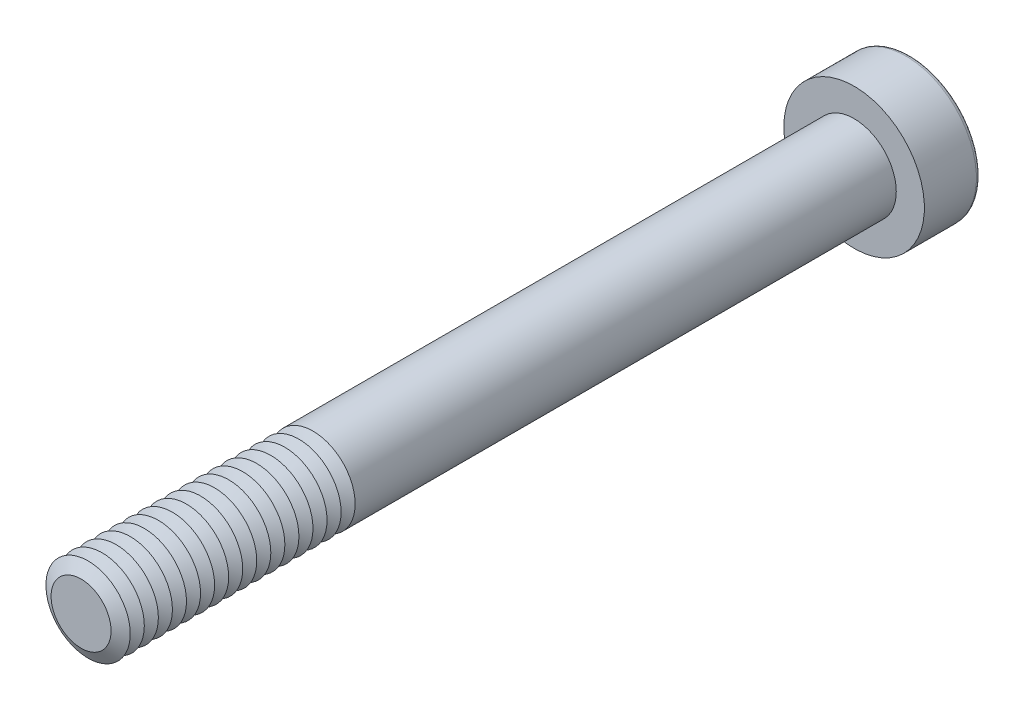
ISO-10303-21;
HEADER;
FILE_DESCRIPTION(('STEP AP214'),'2;1');
FILE_NAME('part.step','',(''),(''),'','','');
FILE_SCHEMA(('AUTOMOTIVE_DESIGN { 1 0 10303 214 1 1 1 1 }'));
ENDSEC;
DATA;
#1=APPLICATION_CONTEXT('core data for automotive mechanical design processes');
#2=APPLICATION_PROTOCOL_DEFINITION('international standard','automotive_design',2000,#1);
#3=PRODUCT_CONTEXT('',#1,'mechanical');
#4=PRODUCT('Part','Part','',(#3));
#5=PRODUCT_RELATED_PRODUCT_CATEGORY('part','',(#4));
#6=PRODUCT_DEFINITION_FORMATION('','',#4);
#7=PRODUCT_DEFINITION_CONTEXT('part definition',#1,'design');
#8=PRODUCT_DEFINITION('design','',#6,#7);
#9=PRODUCT_DEFINITION_SHAPE('','',#8);
#10=(LENGTH_UNIT() NAMED_UNIT(*) SI_UNIT(.MILLI.,.METRE.));
#11=(NAMED_UNIT(*) PLANE_ANGLE_UNIT() SI_UNIT($,.RADIAN.));
#12=(NAMED_UNIT(*) SI_UNIT($,.STERADIAN.) SOLID_ANGLE_UNIT());
#13=UNCERTAINTY_MEASURE_WITH_UNIT(LENGTH_MEASURE(1.E-05),#10,'distance_accuracy_value','');
#14=(GEOMETRIC_REPRESENTATION_CONTEXT(3) GLOBAL_UNCERTAINTY_ASSIGNED_CONTEXT((#13)) GLOBAL_UNIT_ASSIGNED_CONTEXT((#10,
#11,#12)) REPRESENTATION_CONTEXT('',''));
#15=CARTESIAN_POINT('',(0.,0.,0.));
#16=DIRECTION('',(0.,0.,1.));
#17=DIRECTION('',(1.,0.,0.));
#18=AXIS2_PLACEMENT_3D('',#15,#16,#17);
#19=CARTESIAN_POINT('',(0.,0.,51.5));
#20=DIRECTION('',(0.,0.,1.));
#21=DIRECTION('',(1.,0.,0.));
#22=AXIS2_PLACEMENT_3D('',#19,#20,#21);
#23=CONICAL_SURFACE('',#22,3.,1.0471975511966);
#24=CARTESIAN_POINT('',(0.,0.,51.));
#25=DIRECTION('',(0.,0.,1.));
#26=DIRECTION('',(1.,0.,0.));
#27=AXIS2_PLACEMENT_3D('',#24,#25,#26);
#28=CIRCLE('',#27,2.13397459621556);
#29=CARTESIAN_POINT('',(2.13397459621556,0.,51.));
#30=VERTEX_POINT('',#29);
#31=EDGE_CURVE('E313',#30,#30,#28,.T.);
#32=ORIENTED_EDGE('',*,*,#31,.T.);
#33=EDGE_LOOP('',(#32));
#34=FACE_BOUND('',#33,.T.);
#35=CARTESIAN_POINT('',(0.,0.,51.5));
#36=DIRECTION('',(0.,0.,1.));
#37=DIRECTION('',(1.,0.,0.));
#38=AXIS2_PLACEMENT_3D('',#35,#36,#37);
#39=CIRCLE('',#38,3.);
#40=CARTESIAN_POINT('',(3.,0.,51.5));
#41=VERTEX_POINT('',#40);
#42=EDGE_CURVE('E316',#41,#41,#39,.T.);
#43=ORIENTED_EDGE('',*,*,#42,.F.);
#44=EDGE_LOOP('',(#43));
#45=FACE_BOUND('',#44,.T.);
#46=ADVANCED_FACE('F39',(#34,#45),#23,.T.);
#47=CARTESIAN_POINT('',(0.,0.,51.));
#48=DIRECTION('',(0.,0.,-1.));
#49=DIRECTION('',(-1.,0.,0.));
#50=AXIS2_PLACEMENT_3D('',#47,#48,#49);
#51=CONICAL_SURFACE('',#50,2.13397459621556,1.0471975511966);
#52=CARTESIAN_POINT('',(0.,0.,50.5));
#53=DIRECTION('',(0.,0.,1.));
#54=DIRECTION('',(1.,0.,0.));
#55=AXIS2_PLACEMENT_3D('',#52,#53,#54);
#56=CIRCLE('',#55,3.);
#57=CARTESIAN_POINT('',(3.,0.,50.5));
#58=VERTEX_POINT('',#57);
#59=EDGE_CURVE('E324',#58,#58,#56,.T.);
#60=ORIENTED_EDGE('',*,*,#59,.T.);
#61=EDGE_LOOP('',(#60));
#62=FACE_BOUND('',#61,.T.);
#63=ORIENTED_EDGE('',*,*,#31,.F.);
#64=EDGE_LOOP('',(#63));
#65=FACE_BOUND('',#64,.T.);
#66=ADVANCED_FACE('F245',(#62,#65),#51,.T.);
#67=CARTESIAN_POINT('',(0.,0.,55.));
#68=DIRECTION('',(0.,0.,1.));
#69=DIRECTION('',(1.,0.,0.));
#70=AXIS2_PLACEMENT_3D('',#67,#68,#69);
#71=PLANE('',#70);
#72=CARTESIAN_POINT('',(0.,0.,55.));
#73=DIRECTION('',(0.,0.,1.));
#74=DIRECTION('',(1.,0.,0.));
#75=AXIS2_PLACEMENT_3D('',#72,#73,#74);
#76=CIRCLE('',#75,2.13397459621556);
#77=CARTESIAN_POINT('',(2.13397459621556,0.,55.));
#78=VERTEX_POINT('',#77);
#79=EDGE_CURVE('E174',#78,#78,#76,.T.);
#80=ORIENTED_EDGE('',*,*,#79,.T.);
#81=EDGE_LOOP('',(#80));
#82=FACE_BOUND('',#81,.T.);
#83=ADVANCED_FACE('F251',(#82),#71,.T.);
#84=CARTESIAN_POINT('',(0.,0.,55.));
#85=DIRECTION('',(0.,0.,-1.));
#86=DIRECTION('',(-1.,0.,0.));
#87=AXIS2_PLACEMENT_3D('',#84,#85,#86);
#88=CONICAL_SURFACE('',#87,2.13397459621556,1.0471975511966);
#89=CARTESIAN_POINT('',(0.,0.,54.5));
#90=DIRECTION('',(0.,0.,1.));
#91=DIRECTION('',(1.,0.,0.));
#92=AXIS2_PLACEMENT_3D('',#89,#90,#91);
#93=CIRCLE('',#92,3.);
#94=CARTESIAN_POINT('',(3.,0.,54.5));
#95=VERTEX_POINT('',#94);
#96=EDGE_CURVE('E291',#95,#95,#93,.T.);
#97=ORIENTED_EDGE('',*,*,#96,.T.);
#98=EDGE_LOOP('',(#97));
#99=FACE_BOUND('',#98,.T.);
#100=ORIENTED_EDGE('',*,*,#79,.F.);
#101=EDGE_LOOP('',(#100));
#102=FACE_BOUND('',#101,.T.);
#103=ADVANCED_FACE('F199',(#99,#102),#88,.T.);
#104=CARTESIAN_POINT('',(0.,0.,54.5));
#105=DIRECTION('',(0.,0.,1.));
#106=DIRECTION('',(1.,0.,0.));
#107=AXIS2_PLACEMENT_3D('',#104,#105,#106);
#108=CONICAL_SURFACE('',#107,3.,1.0471975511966);
#109=CARTESIAN_POINT('',(0.,0.,54.));
#110=DIRECTION('',(0.,0.,1.));
#111=DIRECTION('',(1.,0.,0.));
#112=AXIS2_PLACEMENT_3D('',#109,#110,#111);
#113=CIRCLE('',#112,2.13397459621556);
#114=CARTESIAN_POINT('',(2.13397459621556,0.,54.));
#115=VERTEX_POINT('',#114);
#116=EDGE_CURVE('E288',#115,#115,#113,.T.);
#117=ORIENTED_EDGE('',*,*,#116,.T.);
#118=EDGE_LOOP('',(#117));
#119=FACE_BOUND('',#118,.T.);
#120=ORIENTED_EDGE('',*,*,#96,.F.);
#121=EDGE_LOOP('',(#120));
#122=FACE_BOUND('',#121,.T.);
#123=ADVANCED_FACE('F277',(#119,#122),#108,.T.);
#124=CARTESIAN_POINT('',(0.,0.,54.));
#125=DIRECTION('',(0.,0.,-1.));
#126=DIRECTION('',(-1.,0.,0.));
#127=AXIS2_PLACEMENT_3D('',#124,#125,#126);
#128=CONICAL_SURFACE('',#127,2.13397459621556,1.0471975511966);
#129=CARTESIAN_POINT('',(0.,0.,53.5));
#130=DIRECTION('',(0.,0.,1.));
#131=DIRECTION('',(1.,0.,0.));
#132=AXIS2_PLACEMENT_3D('',#129,#130,#131);
#133=CIRCLE('',#132,3.);
#134=CARTESIAN_POINT('',(3.,0.,53.5));
#135=VERTEX_POINT('',#134);
#136=EDGE_CURVE('E300',#135,#135,#133,.T.);
#137=ORIENTED_EDGE('',*,*,#136,.T.);
#138=EDGE_LOOP('',(#137));
#139=FACE_BOUND('',#138,.T.);
#140=ORIENTED_EDGE('',*,*,#116,.F.);
#141=EDGE_LOOP('',(#140));
#142=FACE_BOUND('',#141,.T.);
#143=ADVANCED_FACE('F274',(#139,#142),#128,.T.);
#144=CARTESIAN_POINT('',(0.,0.,53.5));
#145=DIRECTION('',(0.,0.,1.));
#146=DIRECTION('',(1.,0.,0.));
#147=AXIS2_PLACEMENT_3D('',#144,#145,#146);
#148=CONICAL_SURFACE('',#147,3.,1.0471975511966);
#149=CARTESIAN_POINT('',(0.,0.,53.));
#150=DIRECTION('',(0.,0.,1.));
#151=DIRECTION('',(1.,0.,0.));
#152=AXIS2_PLACEMENT_3D('',#149,#150,#151);
#153=CIRCLE('',#152,2.13397459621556);
#154=CARTESIAN_POINT('',(2.13397459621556,0.,53.));
#155=VERTEX_POINT('',#154);
#156=EDGE_CURVE('E293',#155,#155,#153,.T.);
#157=ORIENTED_EDGE('',*,*,#156,.T.);
#158=EDGE_LOOP('',(#157));
#159=FACE_BOUND('',#158,.T.);
#160=ORIENTED_EDGE('',*,*,#136,.F.);
#161=EDGE_LOOP('',(#160));
#162=FACE_BOUND('',#161,.T.);
#163=ADVANCED_FACE('F270',(#159,#162),#148,.T.);
#164=CARTESIAN_POINT('',(0.,0.,53.));
#165=DIRECTION('',(0.,0.,-1.));
#166=DIRECTION('',(-1.,0.,0.));
#167=AXIS2_PLACEMENT_3D('',#164,#165,#166);
#168=CONICAL_SURFACE('',#167,2.13397459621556,1.0471975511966);
#169=CARTESIAN_POINT('',(0.,0.,52.5));
#170=DIRECTION('',(0.,0.,1.));
#171=DIRECTION('',(1.,0.,0.));
#172=AXIS2_PLACEMENT_3D('',#169,#170,#171);
#173=CIRCLE('',#172,3.);
#174=CARTESIAN_POINT('',(3.,0.,52.5));
#175=VERTEX_POINT('',#174);
#176=EDGE_CURVE('E309',#175,#175,#173,.T.);
#177=ORIENTED_EDGE('',*,*,#176,.T.);
#178=EDGE_LOOP('',(#177));
#179=FACE_BOUND('',#178,.T.);
#180=ORIENTED_EDGE('',*,*,#156,.F.);
#181=EDGE_LOOP('',(#180));
#182=FACE_BOUND('',#181,.T.);
#183=ADVANCED_FACE('F266',(#179,#182),#168,.T.);
#184=CARTESIAN_POINT('',(0.,0.,52.5));
#185=DIRECTION('',(0.,0.,1.));
#186=DIRECTION('',(1.,0.,0.));
#187=AXIS2_PLACEMENT_3D('',#184,#185,#186);
#188=CONICAL_SURFACE('',#187,3.,1.0471975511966);
#189=CARTESIAN_POINT('',(0.,0.,52.));
#190=DIRECTION('',(0.,0.,1.));
#191=DIRECTION('',(1.,0.,0.));
#192=AXIS2_PLACEMENT_3D('',#189,#190,#191);
#193=CIRCLE('',#192,2.13397459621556);
#194=CARTESIAN_POINT('',(2.13397459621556,0.,52.));
#195=VERTEX_POINT('',#194);
#196=EDGE_CURVE('E306',#195,#195,#193,.T.);
#197=ORIENTED_EDGE('',*,*,#196,.T.);
#198=EDGE_LOOP('',(#197));
#199=FACE_BOUND('',#198,.T.);
#200=ORIENTED_EDGE('',*,*,#176,.F.);
#201=EDGE_LOOP('',(#200));
#202=FACE_BOUND('',#201,.T.);
#203=ADVANCED_FACE('F262',(#199,#202),#188,.T.);
#204=CARTESIAN_POINT('',(0.,0.,52.));
#205=DIRECTION('',(0.,0.,-1.));
#206=DIRECTION('',(-1.,0.,0.));
#207=AXIS2_PLACEMENT_3D('',#204,#205,#206);
#208=CONICAL_SURFACE('',#207,2.13397459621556,1.0471975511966);
#209=ORIENTED_EDGE('',*,*,#42,.T.);
#210=EDGE_LOOP('',(#209));
#211=FACE_BOUND('',#210,.T.);
#212=ORIENTED_EDGE('',*,*,#196,.F.);
#213=EDGE_LOOP('',(#212));
#214=FACE_BOUND('',#213,.T.);
#215=ADVANCED_FACE('F258',(#211,#214),#208,.T.);
#216=CARTESIAN_POINT('',(0.,0.,50.5));
#217=DIRECTION('',(0.,0.,1.));
#218=DIRECTION('',(1.,0.,0.));
#219=AXIS2_PLACEMENT_3D('',#216,#217,#218);
#220=CONICAL_SURFACE('',#219,3.,1.0471975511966);
#221=CARTESIAN_POINT('',(0.,0.,50.));
#222=DIRECTION('',(0.,0.,1.));
#223=DIRECTION('',(1.,0.,0.));
#224=AXIS2_PLACEMENT_3D('',#221,#222,#223);
#225=CIRCLE('',#224,2.13397459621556);
#226=CARTESIAN_POINT('',(2.13397459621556,0.,50.));
#227=VERTEX_POINT('',#226);
#228=EDGE_CURVE('E320',#227,#227,#225,.T.);
#229=ORIENTED_EDGE('',*,*,#228,.T.);
#230=EDGE_LOOP('',(#229));
#231=FACE_BOUND('',#230,.T.);
#232=ORIENTED_EDGE('',*,*,#59,.F.);
#233=EDGE_LOOP('',(#232));
#234=FACE_BOUND('',#233,.T.);
#235=ADVANCED_FACE('F261',(#231,#234),#220,.T.);
#236=CARTESIAN_POINT('',(0.,0.,50.));
#237=DIRECTION('',(0.,0.,-1.));
#238=DIRECTION('',(-1.,0.,0.));
#239=AXIS2_PLACEMENT_3D('',#236,#237,#238);
#240=CONICAL_SURFACE('',#239,2.13397459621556,1.0471975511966);
#241=CARTESIAN_POINT('',(0.,0.,49.5));
#242=DIRECTION('',(0.,0.,1.));
#243=DIRECTION('',(1.,0.,0.));
#244=AXIS2_PLACEMENT_3D('',#241,#242,#243);
#245=CIRCLE('',#244,3.);
#246=CARTESIAN_POINT('',(3.,0.,49.5));
#247=VERTEX_POINT('',#246);
#248=EDGE_CURVE('E332',#247,#247,#245,.T.);
#249=ORIENTED_EDGE('',*,*,#248,.T.);
#250=EDGE_LOOP('',(#249));
#251=FACE_BOUND('',#250,.T.);
#252=ORIENTED_EDGE('',*,*,#228,.F.);
#253=EDGE_LOOP('',(#252));
#254=FACE_BOUND('',#253,.T.);
#255=ADVANCED_FACE('F511',(#251,#254),#240,.T.);
#256=CARTESIAN_POINT('',(0.,0.,49.5));
#257=DIRECTION('',(0.,0.,1.));
#258=DIRECTION('',(1.,0.,0.));
#259=AXIS2_PLACEMENT_3D('',#256,#257,#258);
#260=CONICAL_SURFACE('',#259,3.,1.0471975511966);
#261=CARTESIAN_POINT('',(0.,0.,49.));
#262=DIRECTION('',(0.,0.,1.));
#263=DIRECTION('',(1.,0.,0.));
#264=AXIS2_PLACEMENT_3D('',#261,#262,#263);
#265=CIRCLE('',#264,2.13397459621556);
#266=CARTESIAN_POINT('',(2.13397459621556,0.,49.));
#267=VERTEX_POINT('',#266);
#268=EDGE_CURVE('E328',#267,#267,#265,.T.);
#269=ORIENTED_EDGE('',*,*,#268,.T.);
#270=EDGE_LOOP('',(#269));
#271=FACE_BOUND('',#270,.T.);
#272=ORIENTED_EDGE('',*,*,#248,.F.);
#273=EDGE_LOOP('',(#272));
#274=FACE_BOUND('',#273,.T.);
#275=ADVANCED_FACE('F507',(#271,#274),#260,.T.);
#276=CARTESIAN_POINT('',(0.,0.,49.));
#277=DIRECTION('',(0.,0.,-1.));
#278=DIRECTION('',(-1.,0.,0.));
#279=AXIS2_PLACEMENT_3D('',#276,#277,#278);
#280=CONICAL_SURFACE('',#279,2.13397459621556,1.0471975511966);
#281=CARTESIAN_POINT('',(0.,0.,48.5));
#282=DIRECTION('',(0.,0.,1.));
#283=DIRECTION('',(1.,0.,0.));
#284=AXIS2_PLACEMENT_3D('',#281,#282,#283);
#285=CIRCLE('',#284,3.);
#286=CARTESIAN_POINT('',(3.,0.,48.5));
#287=VERTEX_POINT('',#286);
#288=EDGE_CURVE('E340',#287,#287,#285,.T.);
#289=ORIENTED_EDGE('',*,*,#288,.T.);
#290=EDGE_LOOP('',(#289));
#291=FACE_BOUND('',#290,.T.);
#292=ORIENTED_EDGE('',*,*,#268,.F.);
#293=EDGE_LOOP('',(#292));
#294=FACE_BOUND('',#293,.T.);
#295=ADVANCED_FACE('F503',(#291,#294),#280,.T.);
#296=CARTESIAN_POINT('',(0.,0.,48.5));
#297=DIRECTION('',(0.,0.,1.));
#298=DIRECTION('',(1.,0.,0.));
#299=AXIS2_PLACEMENT_3D('',#296,#297,#298);
#300=CONICAL_SURFACE('',#299,3.,1.0471975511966);
#301=CARTESIAN_POINT('',(0.,0.,48.));
#302=DIRECTION('',(0.,0.,1.));
#303=DIRECTION('',(1.,0.,0.));
#304=AXIS2_PLACEMENT_3D('',#301,#302,#303);
#305=CIRCLE('',#304,2.13397459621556);
#306=CARTESIAN_POINT('',(2.13397459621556,0.,48.));
#307=VERTEX_POINT('',#306);
#308=EDGE_CURVE('E336',#307,#307,#305,.T.);
#309=ORIENTED_EDGE('',*,*,#308,.T.);
#310=EDGE_LOOP('',(#309));
#311=FACE_BOUND('',#310,.T.);
#312=ORIENTED_EDGE('',*,*,#288,.F.);
#313=EDGE_LOOP('',(#312));
#314=FACE_BOUND('',#313,.T.);
#315=ADVANCED_FACE('F499',(#311,#314),#300,.T.);
#316=CARTESIAN_POINT('',(0.,0.,48.));
#317=DIRECTION('',(0.,0.,-1.));
#318=DIRECTION('',(-1.,0.,0.));
#319=AXIS2_PLACEMENT_3D('',#316,#317,#318);
#320=CONICAL_SURFACE('',#319,2.13397459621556,1.0471975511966);
#321=CARTESIAN_POINT('',(0.,0.,47.5));
#322=DIRECTION('',(0.,0.,1.));
#323=DIRECTION('',(1.,0.,0.));
#324=AXIS2_PLACEMENT_3D('',#321,#322,#323);
#325=CIRCLE('',#324,3.);
#326=CARTESIAN_POINT('',(3.,0.,47.5));
#327=VERTEX_POINT('',#326);
#328=EDGE_CURVE('E348',#327,#327,#325,.T.);
#329=ORIENTED_EDGE('',*,*,#328,.T.);
#330=EDGE_LOOP('',(#329));
#331=FACE_BOUND('',#330,.T.);
#332=ORIENTED_EDGE('',*,*,#308,.F.);
#333=EDGE_LOOP('',(#332));
#334=FACE_BOUND('',#333,.T.);
#335=ADVANCED_FACE('F495',(#331,#334),#320,.T.);
#336=CARTESIAN_POINT('',(0.,0.,47.5));
#337=DIRECTION('',(0.,0.,1.));
#338=DIRECTION('',(1.,0.,0.));
#339=AXIS2_PLACEMENT_3D('',#336,#337,#338);
#340=CONICAL_SURFACE('',#339,3.,1.0471975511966);
#341=CARTESIAN_POINT('',(0.,0.,47.));
#342=DIRECTION('',(0.,0.,1.));
#343=DIRECTION('',(1.,0.,0.));
#344=AXIS2_PLACEMENT_3D('',#341,#342,#343);
#345=CIRCLE('',#344,2.13397459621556);
#346=CARTESIAN_POINT('',(2.13397459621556,0.,47.));
#347=VERTEX_POINT('',#346);
#348=EDGE_CURVE('E344',#347,#347,#345,.T.);
#349=ORIENTED_EDGE('',*,*,#348,.T.);
#350=EDGE_LOOP('',(#349));
#351=FACE_BOUND('',#350,.T.);
#352=ORIENTED_EDGE('',*,*,#328,.F.);
#353=EDGE_LOOP('',(#352));
#354=FACE_BOUND('',#353,.T.);
#355=ADVANCED_FACE('F491',(#351,#354),#340,.T.);
#356=CARTESIAN_POINT('',(0.,0.,47.));
#357=DIRECTION('',(0.,0.,-1.));
#358=DIRECTION('',(-1.,0.,0.));
#359=AXIS2_PLACEMENT_3D('',#356,#357,#358);
#360=CONICAL_SURFACE('',#359,2.13397459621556,1.0471975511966);
#361=CARTESIAN_POINT('',(0.,0.,46.5));
#362=DIRECTION('',(0.,0.,1.));
#363=DIRECTION('',(1.,0.,0.));
#364=AXIS2_PLACEMENT_3D('',#361,#362,#363);
#365=CIRCLE('',#364,3.);
#366=CARTESIAN_POINT('',(3.,0.,46.5));
#367=VERTEX_POINT('',#366);
#368=EDGE_CURVE('E356',#367,#367,#365,.T.);
#369=ORIENTED_EDGE('',*,*,#368,.T.);
#370=EDGE_LOOP('',(#369));
#371=FACE_BOUND('',#370,.T.);
#372=ORIENTED_EDGE('',*,*,#348,.F.);
#373=EDGE_LOOP('',(#372));
#374=FACE_BOUND('',#373,.T.);
#375=ADVANCED_FACE('F487',(#371,#374),#360,.T.);
#376=CARTESIAN_POINT('',(0.,0.,46.5));
#377=DIRECTION('',(0.,0.,1.));
#378=DIRECTION('',(1.,0.,0.));
#379=AXIS2_PLACEMENT_3D('',#376,#377,#378);
#380=CONICAL_SURFACE('',#379,3.,1.0471975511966);
#381=CARTESIAN_POINT('',(0.,0.,46.));
#382=DIRECTION('',(0.,0.,1.));
#383=DIRECTION('',(1.,0.,0.));
#384=AXIS2_PLACEMENT_3D('',#381,#382,#383);
#385=CIRCLE('',#384,2.13397459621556);
#386=CARTESIAN_POINT('',(2.13397459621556,0.,46.));
#387=VERTEX_POINT('',#386);
#388=EDGE_CURVE('E352',#387,#387,#385,.T.);
#389=ORIENTED_EDGE('',*,*,#388,.T.);
#390=EDGE_LOOP('',(#389));
#391=FACE_BOUND('',#390,.T.);
#392=ORIENTED_EDGE('',*,*,#368,.F.);
#393=EDGE_LOOP('',(#392));
#394=FACE_BOUND('',#393,.T.);
#395=ADVANCED_FACE('F483',(#391,#394),#380,.T.);
#396=CARTESIAN_POINT('',(0.,0.,46.));
#397=DIRECTION('',(0.,0.,-1.));
#398=DIRECTION('',(-1.,0.,0.));
#399=AXIS2_PLACEMENT_3D('',#396,#397,#398);
#400=CONICAL_SURFACE('',#399,2.13397459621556,1.0471975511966);
#401=CARTESIAN_POINT('',(0.,0.,45.5));
#402=DIRECTION('',(0.,0.,1.));
#403=DIRECTION('',(1.,0.,0.));
#404=AXIS2_PLACEMENT_3D('',#401,#402,#403);
#405=CIRCLE('',#404,3.);
#406=CARTESIAN_POINT('',(3.,0.,45.5));
#407=VERTEX_POINT('',#406);
#408=EDGE_CURVE('E364',#407,#407,#405,.T.);
#409=ORIENTED_EDGE('',*,*,#408,.T.);
#410=EDGE_LOOP('',(#409));
#411=FACE_BOUND('',#410,.T.);
#412=ORIENTED_EDGE('',*,*,#388,.F.);
#413=EDGE_LOOP('',(#412));
#414=FACE_BOUND('',#413,.T.);
#415=ADVANCED_FACE('F479',(#411,#414),#400,.T.);
#416=CARTESIAN_POINT('',(0.,0.,45.5));
#417=DIRECTION('',(0.,0.,1.));
#418=DIRECTION('',(1.,0.,0.));
#419=AXIS2_PLACEMENT_3D('',#416,#417,#418);
#420=CONICAL_SURFACE('',#419,3.,1.0471975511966);
#421=CARTESIAN_POINT('',(0.,0.,45.));
#422=DIRECTION('',(0.,0.,1.));
#423=DIRECTION('',(1.,0.,0.));
#424=AXIS2_PLACEMENT_3D('',#421,#422,#423);
#425=CIRCLE('',#424,2.13397459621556);
#426=CARTESIAN_POINT('',(2.13397459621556,0.,45.));
#427=VERTEX_POINT('',#426);
#428=EDGE_CURVE('E360',#427,#427,#425,.T.);
#429=ORIENTED_EDGE('',*,*,#428,.T.);
#430=EDGE_LOOP('',(#429));
#431=FACE_BOUND('',#430,.T.);
#432=ORIENTED_EDGE('',*,*,#408,.F.);
#433=EDGE_LOOP('',(#432));
#434=FACE_BOUND('',#433,.T.);
#435=ADVANCED_FACE('F475',(#431,#434),#420,.T.);
#436=CARTESIAN_POINT('',(0.,0.,45.));
#437=DIRECTION('',(0.,0.,-1.));
#438=DIRECTION('',(-1.,0.,0.));
#439=AXIS2_PLACEMENT_3D('',#436,#437,#438);
#440=CONICAL_SURFACE('',#439,2.13397459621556,1.0471975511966);
#441=CARTESIAN_POINT('',(0.,0.,44.5));
#442=DIRECTION('',(0.,0.,1.));
#443=DIRECTION('',(1.,0.,0.));
#444=AXIS2_PLACEMENT_3D('',#441,#442,#443);
#445=CIRCLE('',#444,3.);
#446=CARTESIAN_POINT('',(3.,0.,44.5));
#447=VERTEX_POINT('',#446);
#448=EDGE_CURVE('E372',#447,#447,#445,.T.);
#449=ORIENTED_EDGE('',*,*,#448,.T.);
#450=EDGE_LOOP('',(#449));
#451=FACE_BOUND('',#450,.T.);
#452=ORIENTED_EDGE('',*,*,#428,.F.);
#453=EDGE_LOOP('',(#452));
#454=FACE_BOUND('',#453,.T.);
#455=ADVANCED_FACE('F471',(#451,#454),#440,.T.);
#456=CARTESIAN_POINT('',(0.,0.,44.5));
#457=DIRECTION('',(0.,0.,1.));
#458=DIRECTION('',(1.,0.,0.));
#459=AXIS2_PLACEMENT_3D('',#456,#457,#458);
#460=CONICAL_SURFACE('',#459,3.,1.0471975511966);
#461=CARTESIAN_POINT('',(0.,0.,44.));
#462=DIRECTION('',(0.,0.,1.));
#463=DIRECTION('',(1.,0.,0.));
#464=AXIS2_PLACEMENT_3D('',#461,#462,#463);
#465=CIRCLE('',#464,2.13397459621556);
#466=CARTESIAN_POINT('',(2.13397459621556,0.,44.));
#467=VERTEX_POINT('',#466);
#468=EDGE_CURVE('E368',#467,#467,#465,.T.);
#469=ORIENTED_EDGE('',*,*,#468,.T.);
#470=EDGE_LOOP('',(#469));
#471=FACE_BOUND('',#470,.T.);
#472=ORIENTED_EDGE('',*,*,#448,.F.);
#473=EDGE_LOOP('',(#472));
#474=FACE_BOUND('',#473,.T.);
#475=ADVANCED_FACE('F467',(#471,#474),#460,.T.);
#476=CARTESIAN_POINT('',(0.,0.,44.));
#477=DIRECTION('',(0.,0.,-1.));
#478=DIRECTION('',(-1.,0.,0.));
#479=AXIS2_PLACEMENT_3D('',#476,#477,#478);
#480=CONICAL_SURFACE('',#479,2.13397459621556,1.0471975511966);
#481=CARTESIAN_POINT('',(0.,0.,43.5));
#482=DIRECTION('',(0.,0.,1.));
#483=DIRECTION('',(1.,0.,0.));
#484=AXIS2_PLACEMENT_3D('',#481,#482,#483);
#485=CIRCLE('',#484,3.);
#486=CARTESIAN_POINT('',(3.,0.,43.5));
#487=VERTEX_POINT('',#486);
#488=EDGE_CURVE('E380',#487,#487,#485,.T.);
#489=ORIENTED_EDGE('',*,*,#488,.T.);
#490=EDGE_LOOP('',(#489));
#491=FACE_BOUND('',#490,.T.);
#492=ORIENTED_EDGE('',*,*,#468,.F.);
#493=EDGE_LOOP('',(#492));
#494=FACE_BOUND('',#493,.T.);
#495=ADVANCED_FACE('F463',(#491,#494),#480,.T.);
#496=CARTESIAN_POINT('',(0.,0.,43.5));
#497=DIRECTION('',(0.,0.,1.));
#498=DIRECTION('',(1.,0.,0.));
#499=AXIS2_PLACEMENT_3D('',#496,#497,#498);
#500=CONICAL_SURFACE('',#499,3.,1.0471975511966);
#501=CARTESIAN_POINT('',(0.,0.,43.));
#502=DIRECTION('',(0.,0.,1.));
#503=DIRECTION('',(1.,0.,0.));
#504=AXIS2_PLACEMENT_3D('',#501,#502,#503);
#505=CIRCLE('',#504,2.13397459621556);
#506=CARTESIAN_POINT('',(2.13397459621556,0.,43.));
#507=VERTEX_POINT('',#506);
#508=EDGE_CURVE('E376',#507,#507,#505,.T.);
#509=ORIENTED_EDGE('',*,*,#508,.T.);
#510=EDGE_LOOP('',(#509));
#511=FACE_BOUND('',#510,.T.);
#512=ORIENTED_EDGE('',*,*,#488,.F.);
#513=EDGE_LOOP('',(#512));
#514=FACE_BOUND('',#513,.T.);
#515=ADVANCED_FACE('F459',(#511,#514),#500,.T.);
#516=CARTESIAN_POINT('',(0.,0.,43.));
#517=DIRECTION('',(0.,0.,-1.));
#518=DIRECTION('',(-1.,0.,0.));
#519=AXIS2_PLACEMENT_3D('',#516,#517,#518);
#520=CONICAL_SURFACE('',#519,2.13397459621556,1.0471975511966);
#521=CARTESIAN_POINT('',(0.,0.,42.5));
#522=DIRECTION('',(0.,0.,1.));
#523=DIRECTION('',(1.,0.,0.));
#524=AXIS2_PLACEMENT_3D('',#521,#522,#523);
#525=CIRCLE('',#524,3.);
#526=CARTESIAN_POINT('',(3.,0.,42.5));
#527=VERTEX_POINT('',#526);
#528=EDGE_CURVE('E388',#527,#527,#525,.T.);
#529=ORIENTED_EDGE('',*,*,#528,.T.);
#530=EDGE_LOOP('',(#529));
#531=FACE_BOUND('',#530,.T.);
#532=ORIENTED_EDGE('',*,*,#508,.F.);
#533=EDGE_LOOP('',(#532));
#534=FACE_BOUND('',#533,.T.);
#535=ADVANCED_FACE('F455',(#531,#534),#520,.T.);
#536=CARTESIAN_POINT('',(0.,0.,42.5));
#537=DIRECTION('',(0.,0.,1.));
#538=DIRECTION('',(1.,0.,0.));
#539=AXIS2_PLACEMENT_3D('',#536,#537,#538);
#540=CONICAL_SURFACE('',#539,3.,1.0471975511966);
#541=CARTESIAN_POINT('',(0.,0.,42.));
#542=DIRECTION('',(0.,0.,1.));
#543=DIRECTION('',(1.,0.,0.));
#544=AXIS2_PLACEMENT_3D('',#541,#542,#543);
#545=CIRCLE('',#544,2.13397459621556);
#546=CARTESIAN_POINT('',(2.13397459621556,0.,42.));
#547=VERTEX_POINT('',#546);
#548=EDGE_CURVE('E384',#547,#547,#545,.T.);
#549=ORIENTED_EDGE('',*,*,#548,.T.);
#550=EDGE_LOOP('',(#549));
#551=FACE_BOUND('',#550,.T.);
#552=ORIENTED_EDGE('',*,*,#528,.F.);
#553=EDGE_LOOP('',(#552));
#554=FACE_BOUND('',#553,.T.);
#555=ADVANCED_FACE('F451',(#551,#554),#540,.T.);
#556=CARTESIAN_POINT('',(0.,0.,42.));
#557=DIRECTION('',(0.,0.,-1.));
#558=DIRECTION('',(-1.,0.,0.));
#559=AXIS2_PLACEMENT_3D('',#556,#557,#558);
#560=CONICAL_SURFACE('',#559,2.13397459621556,1.0471975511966);
#561=CARTESIAN_POINT('',(0.,0.,41.5));
#562=DIRECTION('',(0.,0.,1.));
#563=DIRECTION('',(1.,0.,0.));
#564=AXIS2_PLACEMENT_3D('',#561,#562,#563);
#565=CIRCLE('',#564,3.);
#566=CARTESIAN_POINT('',(3.,0.,41.5));
#567=VERTEX_POINT('',#566);
#568=EDGE_CURVE('E396',#567,#567,#565,.T.);
#569=ORIENTED_EDGE('',*,*,#568,.T.);
#570=EDGE_LOOP('',(#569));
#571=FACE_BOUND('',#570,.T.);
#572=ORIENTED_EDGE('',*,*,#548,.F.);
#573=EDGE_LOOP('',(#572));
#574=FACE_BOUND('',#573,.T.);
#575=ADVANCED_FACE('F447',(#571,#574),#560,.T.);
#576=CARTESIAN_POINT('',(0.,0.,41.5));
#577=DIRECTION('',(0.,0.,1.));
#578=DIRECTION('',(1.,0.,0.));
#579=AXIS2_PLACEMENT_3D('',#576,#577,#578);
#580=CONICAL_SURFACE('',#579,3.,1.0471975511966);
#581=CARTESIAN_POINT('',(0.,0.,41.));
#582=DIRECTION('',(0.,0.,1.));
#583=DIRECTION('',(1.,0.,0.));
#584=AXIS2_PLACEMENT_3D('',#581,#582,#583);
#585=CIRCLE('',#584,2.13397459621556);
#586=CARTESIAN_POINT('',(2.13397459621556,0.,41.));
#587=VERTEX_POINT('',#586);
#588=EDGE_CURVE('E392',#587,#587,#585,.T.);
#589=ORIENTED_EDGE('',*,*,#588,.T.);
#590=EDGE_LOOP('',(#589));
#591=FACE_BOUND('',#590,.T.);
#592=ORIENTED_EDGE('',*,*,#568,.F.);
#593=EDGE_LOOP('',(#592));
#594=FACE_BOUND('',#593,.T.);
#595=ADVANCED_FACE('F443',(#591,#594),#580,.T.);
#596=CARTESIAN_POINT('',(0.,0.,41.));
#597=DIRECTION('',(0.,0.,-1.));
#598=DIRECTION('',(-1.,0.,0.));
#599=AXIS2_PLACEMENT_3D('',#596,#597,#598);
#600=CONICAL_SURFACE('',#599,2.13397459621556,1.0471975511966);
#601=CARTESIAN_POINT('',(0.,0.,40.5));
#602=DIRECTION('',(0.,0.,1.));
#603=DIRECTION('',(1.,0.,0.));
#604=AXIS2_PLACEMENT_3D('',#601,#602,#603);
#605=CIRCLE('',#604,3.);
#606=CARTESIAN_POINT('',(3.,0.,40.5));
#607=VERTEX_POINT('',#606);
#608=EDGE_CURVE('E403',#607,#607,#605,.T.);
#609=ORIENTED_EDGE('',*,*,#608,.T.);
#610=EDGE_LOOP('',(#609));
#611=FACE_BOUND('',#610,.T.);
#612=ORIENTED_EDGE('',*,*,#588,.F.);
#613=EDGE_LOOP('',(#612));
#614=FACE_BOUND('',#613,.T.);
#615=ADVANCED_FACE('F439',(#611,#614),#600,.T.);
#616=CARTESIAN_POINT('',(0.,0.,40.5));
#617=DIRECTION('',(0.,0.,1.));
#618=DIRECTION('',(1.,0.,0.));
#619=AXIS2_PLACEMENT_3D('',#616,#617,#618);
#620=CONICAL_SURFACE('',#619,3.,1.0471975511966);
#621=CARTESIAN_POINT('',(0.,0.,40.));
#622=DIRECTION('',(0.,0.,1.));
#623=DIRECTION('',(1.,0.,0.));
#624=AXIS2_PLACEMENT_3D('',#621,#622,#623);
#625=CIRCLE('',#624,2.13397459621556);
#626=CARTESIAN_POINT('',(2.13397459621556,0.,40.));
#627=VERTEX_POINT('',#626);
#628=EDGE_CURVE('E400',#627,#627,#625,.T.);
#629=ORIENTED_EDGE('',*,*,#628,.T.);
#630=EDGE_LOOP('',(#629));
#631=FACE_BOUND('',#630,.T.);
#632=ORIENTED_EDGE('',*,*,#608,.F.);
#633=EDGE_LOOP('',(#632));
#634=FACE_BOUND('',#633,.T.);
#635=ADVANCED_FACE('F434',(#631,#634),#620,.T.);
#636=CARTESIAN_POINT('',(0.,0.,40.));
#637=DIRECTION('',(0.,0.,-1.));
#638=DIRECTION('',(-1.,0.,0.));
#639=AXIS2_PLACEMENT_3D('',#636,#637,#638);
#640=CONICAL_SURFACE('',#639,2.13397459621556,1.0471975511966);
#641=CARTESIAN_POINT('',(0.,0.,39.5));
#642=DIRECTION('',(0.,0.,1.));
#643=DIRECTION('',(1.,0.,0.));
#644=AXIS2_PLACEMENT_3D('',#641,#642,#643);
#645=CIRCLE('',#644,3.);
#646=CARTESIAN_POINT('',(3.,0.,39.5));
#647=VERTEX_POINT('',#646);
#648=EDGE_CURVE('E415',#647,#647,#645,.T.);
#649=ORIENTED_EDGE('',*,*,#648,.T.);
#650=EDGE_LOOP('',(#649));
#651=FACE_BOUND('',#650,.T.);
#652=ORIENTED_EDGE('',*,*,#628,.F.);
#653=EDGE_LOOP('',(#652));
#654=FACE_BOUND('',#653,.T.);
#655=ADVANCED_FACE('F420',(#651,#654),#640,.T.);
#656=CARTESIAN_POINT('',(0.,0.,39.5));
#657=DIRECTION('',(0.,0.,1.));
#658=DIRECTION('',(1.,0.,0.));
#659=AXIS2_PLACEMENT_3D('',#656,#657,#658);
#660=CONICAL_SURFACE('',#659,3.,1.0471975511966);
#661=CARTESIAN_POINT('',(0.,0.,39.));
#662=DIRECTION('',(0.,0.,1.));
#663=DIRECTION('',(1.,0.,0.));
#664=AXIS2_PLACEMENT_3D('',#661,#662,#663);
#665=CIRCLE('',#664,2.13397459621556);
#666=CARTESIAN_POINT('',(2.13397459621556,0.,39.));
#667=VERTEX_POINT('',#666);
#668=EDGE_CURVE('E407',#667,#667,#665,.T.);
#669=ORIENTED_EDGE('',*,*,#668,.T.);
#670=EDGE_LOOP('',(#669));
#671=FACE_BOUND('',#670,.T.);
#672=ORIENTED_EDGE('',*,*,#648,.F.);
#673=EDGE_LOOP('',(#672));
#674=FACE_BOUND('',#673,.T.);
#675=ADVANCED_FACE('F423',(#671,#674),#660,.T.);
#676=CARTESIAN_POINT('',(0.,0.,39.));
#677=DIRECTION('',(0.,0.,-1.));
#678=DIRECTION('',(-1.,0.,0.));
#679=AXIS2_PLACEMENT_3D('',#676,#677,#678);
#680=CONICAL_SURFACE('',#679,2.13397459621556,1.0471975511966);
#681=CARTESIAN_POINT('',(0.,0.,38.5));
#682=DIRECTION('',(0.,0.,1.));
#683=DIRECTION('',(1.,0.,0.));
#684=AXIS2_PLACEMENT_3D('',#681,#682,#683);
#685=CIRCLE('',#684,3.);
#686=CARTESIAN_POINT('',(3.,0.,38.5));
#687=VERTEX_POINT('',#686);
#688=EDGE_CURVE('E411',#687,#687,#685,.T.);
#689=ORIENTED_EDGE('',*,*,#688,.T.);
#690=EDGE_LOOP('',(#689));
#691=FACE_BOUND('',#690,.T.);
#692=ORIENTED_EDGE('',*,*,#668,.F.);
#693=EDGE_LOOP('',(#692));
#694=FACE_BOUND('',#693,.T.);
#695=ADVANCED_FACE('F425',(#691,#694),#680,.T.);
#696=CARTESIAN_POINT('',(0.,0.,-1.));
#697=DIRECTION('',(0.,0.,-1.));
#698=DIRECTION('',(-1.,0.,0.));
#699=AXIS2_PLACEMENT_3D('',#696,#697,#698);
#700=CONICAL_SURFACE('',#699,2.,1.0471975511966);
#701=CARTESIAN_POINT('',(0.,0.,0.154700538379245));
#702=VERTEX_POINT('',#701);
#703=VERTEX_LOOP('',#702);
#704=FACE_BOUND('',#703,.T.);
#705=CARTESIAN_POINT('',(0.,0.,-1.));
#706=DIRECTION('',(0.,0.,-1.));
#707=DIRECTION('',(-1.,0.,0.));
#708=AXIS2_PLACEMENT_3D('',#705,#706,#707);
#709=CIRCLE('',#708,2.);
#710=CARTESIAN_POINT('',(-1.73205080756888,0.999999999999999,-1.));
#711=VERTEX_POINT('',#710);
#712=CARTESIAN_POINT('',(0.,2.,-1.));
#713=VERTEX_POINT('',#712);
#714=EDGE_CURVE('E149',#711,#713,#709,.T.);
#715=ORIENTED_EDGE('',*,*,#714,.T.);
#716=CARTESIAN_POINT('',(0.,0.,-1.));
#717=DIRECTION('',(0.,0.,-1.));
#718=DIRECTION('',(-1.,0.,0.));
#719=AXIS2_PLACEMENT_3D('',#716,#717,#718);
#720=CIRCLE('',#719,2.);
#721=CARTESIAN_POINT('',(1.73205080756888,1.,-1.));
#722=VERTEX_POINT('',#721);
#723=EDGE_CURVE('E54',#713,#722,#720,.T.);
#724=ORIENTED_EDGE('',*,*,#723,.T.);
#725=CARTESIAN_POINT('',(1.73205080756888,-0.999999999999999,-1.));
#726=VERTEX_POINT('',#725);
#727=EDGE_CURVE('E1028',#722,#726,#720,.T.);
#728=ORIENTED_EDGE('',*,*,#727,.T.);
#729=CARTESIAN_POINT('',(0.,-2.,-1.));
#730=VERTEX_POINT('',#729);
#731=EDGE_CURVE('E1026',#726,#730,#720,.T.);
#732=ORIENTED_EDGE('',*,*,#731,.T.);
#733=CARTESIAN_POINT('',(-1.73205080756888,-0.999999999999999,-1.));
#734=VERTEX_POINT('',#733);
#735=EDGE_CURVE('E1020',#730,#734,#720,.T.);
#736=ORIENTED_EDGE('',*,*,#735,.T.);
#737=EDGE_CURVE('E1018',#734,#711,#720,.T.);
#738=ORIENTED_EDGE('',*,*,#737,.T.);
#739=EDGE_LOOP('',(#715,#724,#728,#732,#736,#738));
#740=FACE_BOUND('',#739,.T.);
#741=ADVANCED_FACE('F201',(#704,#740),#700,.F.);
#742=CARTESIAN_POINT('',(0.,0.,-1.));
#743=DIRECTION('',(0.,0.,-1.));
#744=DIRECTION('',(-1.,0.,0.));
#745=AXIS2_PLACEMENT_3D('',#742,#743,#744);
#746=PLANE('',#745);
#747=ORIENTED_EDGE('',*,*,#723,.F.);
#748=DIRECTION('',(1.,0.,0.));
#749=VECTOR('',#748,1.);
#750=CARTESIAN_POINT('',(-1.15470053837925,2.,-1.));
#751=LINE('',#750,#749);
#752=CARTESIAN_POINT('',(1.15470053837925,2.,-1.));
#753=VERTEX_POINT('',#752);
#754=EDGE_CURVE('E1062',#713,#753,#751,.T.);
#755=ORIENTED_EDGE('',*,*,#754,.T.);
#756=DIRECTION('',(0.5,-0.866025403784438,0.));
#757=VECTOR('',#756,1.);
#758=CARTESIAN_POINT('',(1.15470053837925,2.,-1.));
#759=LINE('',#758,#757);
#760=EDGE_CURVE('E155',#753,#722,#759,.T.);
#761=ORIENTED_EDGE('',*,*,#760,.T.);
#762=EDGE_LOOP('',(#747,#755,#761));
#763=FACE_BOUND('',#762,.T.);
#764=ADVANCED_FACE('F606',(#763),#746,.T.);
#765=ORIENTED_EDGE('',*,*,#727,.F.);
#766=CARTESIAN_POINT('',(2.3094010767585,0.,-1.));
#767=VERTEX_POINT('',#766);
#768=EDGE_CURVE('E1067',#722,#767,#759,.T.);
#769=ORIENTED_EDGE('',*,*,#768,.T.);
#770=DIRECTION('',(-0.5,-0.866025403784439,0.));
#771=VECTOR('',#770,1.);
#772=CARTESIAN_POINT('',(2.3094010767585,0.,-1.));
#773=LINE('',#772,#771);
#774=EDGE_CURVE('E1040',#767,#726,#773,.T.);
#775=ORIENTED_EDGE('',*,*,#774,.T.);
#776=EDGE_LOOP('',(#765,#769,#775));
#777=FACE_BOUND('',#776,.T.);
#778=ADVANCED_FACE('F616',(#777),#746,.T.);
#779=ORIENTED_EDGE('',*,*,#731,.F.);
#780=CARTESIAN_POINT('',(1.15470053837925,-2.,-1.));
#781=VERTEX_POINT('',#780);
#782=EDGE_CURVE('E1042',#726,#781,#773,.T.);
#783=ORIENTED_EDGE('',*,*,#782,.T.);
#784=DIRECTION('',(-1.,0.,0.));
#785=VECTOR('',#784,1.);
#786=CARTESIAN_POINT('',(1.15470053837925,-2.,-1.));
#787=LINE('',#786,#785);
#788=EDGE_CURVE('E992',#781,#730,#787,.T.);
#789=ORIENTED_EDGE('',*,*,#788,.T.);
#790=EDGE_LOOP('',(#779,#783,#789));
#791=FACE_BOUND('',#790,.T.);
#792=ADVANCED_FACE('F626',(#791),#746,.T.);
#793=ORIENTED_EDGE('',*,*,#735,.F.);
#794=CARTESIAN_POINT('',(-1.15470053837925,-2.,-1.));
#795=VERTEX_POINT('',#794);
#796=EDGE_CURVE('E1036',#730,#795,#787,.T.);
#797=ORIENTED_EDGE('',*,*,#796,.T.);
#798=DIRECTION('',(-0.5,0.866025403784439,0.));
#799=VECTOR('',#798,1.);
#800=CARTESIAN_POINT('',(-1.15470053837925,-2.,-1.));
#801=LINE('',#800,#799);
#802=EDGE_CURVE('E1038',#795,#734,#801,.T.);
#803=ORIENTED_EDGE('',*,*,#802,.T.);
#804=EDGE_LOOP('',(#793,#797,#803));
#805=FACE_BOUND('',#804,.T.);
#806=ADVANCED_FACE('F634',(#805),#746,.T.);
#807=ORIENTED_EDGE('',*,*,#737,.F.);
#808=CARTESIAN_POINT('',(-2.3094010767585,0.,-1.));
#809=VERTEX_POINT('',#808);
#810=EDGE_CURVE('E1044',#734,#809,#801,.T.);
#811=ORIENTED_EDGE('',*,*,#810,.T.);
#812=DIRECTION('',(0.5,0.866025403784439,0.));
#813=VECTOR('',#812,1.);
#814=CARTESIAN_POINT('',(-2.3094010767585,0.,-1.));
#815=LINE('',#814,#813);
#816=EDGE_CURVE('E158',#809,#711,#815,.T.);
#817=ORIENTED_EDGE('',*,*,#816,.T.);
#818=EDGE_LOOP('',(#807,#811,#817));
#819=FACE_BOUND('',#818,.T.);
#820=ADVANCED_FACE('F231',(#819),#746,.T.);
#821=ORIENTED_EDGE('',*,*,#714,.F.);
#822=CARTESIAN_POINT('',(-1.15470053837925,2.,-1.));
#823=VERTEX_POINT('',#822);
#824=EDGE_CURVE('E1050',#711,#823,#815,.T.);
#825=ORIENTED_EDGE('',*,*,#824,.T.);
#826=EDGE_CURVE('E1063',#823,#713,#751,.T.);
#827=ORIENTED_EDGE('',*,*,#826,.T.);
#828=EDGE_LOOP('',(#821,#825,#827));
#829=FACE_BOUND('',#828,.T.);
#830=ADVANCED_FACE('F618',(#829),#746,.T.);
#831=CARTESIAN_POINT('',(-1.15470053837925,2.,-1.));
#832=DIRECTION('',(0.,1.,0.));
#833=DIRECTION('',(0.,0.,1.));
#834=AXIS2_PLACEMENT_3D('',#831,#832,#833);
#835=PLANE('',#834);
#836=DIRECTION('',(0.,0.,-1.));
#837=VECTOR('',#836,1.);
#838=CARTESIAN_POINT('',(-1.15470053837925,2.,-1.));
#839=LINE('',#838,#837);
#840=CARTESIAN_POINT('',(-1.15470053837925,2.,-4.));
#841=VERTEX_POINT('',#840);
#842=EDGE_CURVE('E147',#823,#841,#839,.T.);
#843=ORIENTED_EDGE('',*,*,#842,.T.);
#844=CARTESIAN_POINT('',(-3.01440758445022,2.,-4.35051689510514));
#845=CARTESIAN_POINT('',(-2.92409762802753,2.,-4.33035636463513));
#846=CARTESIAN_POINT('',(-2.83373054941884,2.,-4.31045254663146));
#847=CARTESIAN_POINT('',(-2.65285291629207,2.,-4.27128852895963));
#848=CARTESIAN_POINT('',(-2.562342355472,2.,-4.25202835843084));
#849=CARTESIAN_POINT('',(-2.29037985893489,2.,-4.19537300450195));
#850=CARTESIAN_POINT('',(-2.10868043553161,2.,-4.15914446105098));
#851=CARTESIAN_POINT('',(-1.74597297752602,2.,-4.09171688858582));
#852=CARTESIAN_POINT('',(-1.56497266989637,2.,-4.06047686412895));
#853=CARTESIAN_POINT('',(-1.20186568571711,2.,-4.00513826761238));
#854=CARTESIAN_POINT('',(-1.01975924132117,2.,-3.98103824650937));
#855=CARTESIAN_POINT('',(-0.744747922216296,2.,-3.9525901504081));
#856=CARTESIAN_POINT('',(-0.652245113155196,2.,-3.9443671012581));
#857=CARTESIAN_POINT('',(-0.467020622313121,2.,-3.93099406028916));
#858=CARTESIAN_POINT('',(-0.374298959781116,2.,-3.92584380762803));
#859=CARTESIAN_POINT('',(-0.188764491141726,2.,-3.91891540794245));
#860=CARTESIAN_POINT('',(-0.0959517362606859,2.,-3.91713591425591));
#861=CARTESIAN_POINT('',(0.0896753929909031,2.,-3.91705786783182));
#862=CARTESIAN_POINT('',(0.182489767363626,2.,-3.91875932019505));
#863=CARTESIAN_POINT('',(0.368369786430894,2.,-3.92554892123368));
#864=CARTESIAN_POINT('',(0.461434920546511,2.,-3.93065079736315));
#865=CARTESIAN_POINT('',(0.647346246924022,2.,-3.94395663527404));
#866=CARTESIAN_POINT('',(0.740192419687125,2.,-3.95216086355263));
#867=CARTESIAN_POINT('',(1.01841374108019,2.,-3.98081777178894));
#868=CARTESIAN_POINT('',(1.2033713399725,2.,-4.00531018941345));
#869=CARTESIAN_POINT('',(1.57694396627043,2.,-4.06236202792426));
#870=CARTESIAN_POINT('',(1.76552771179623,2.,-4.09511615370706));
#871=CARTESIAN_POINT('',(2.14178491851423,2.,-4.1655706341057));
#872=CARTESIAN_POINT('',(2.32945822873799,2.,-4.20327178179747));
#873=CARTESIAN_POINT('',(2.70417911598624,2.,-4.28188312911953));
#874=CARTESIAN_POINT('',(2.89122649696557,2.,-4.32279425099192));
#875=CARTESIAN_POINT('',(3.26484478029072,2.,-4.40674298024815));
#876=CARTESIAN_POINT('',(3.45141567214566,2.,-4.44978063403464));
#877=CARTESIAN_POINT('',(3.821938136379,2.,-4.53678178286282));
#878=CARTESIAN_POINT('',(4.00589388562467,2.,-4.58072756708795));
#879=CARTESIAN_POINT('',(4.37356350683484,2.,-4.66963526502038));
#880=CARTESIAN_POINT('',(4.55727737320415,2.,-4.71459720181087));
#881=CARTESIAN_POINT('',(4.9242660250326,2.,-4.80519833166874));
#882=CARTESIAN_POINT('',(5.10754106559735,2.,-4.85083649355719));
#883=CARTESIAN_POINT('',(5.47394280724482,2.,-4.94267693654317));
#884=CARTESIAN_POINT('',(5.65706951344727,2.,-4.98887919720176));
#885=CARTESIAN_POINT('',(5.84014583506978,2.,-5.03527803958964));
#886=B_SPLINE_CURVE_WITH_KNOTS('',3,(#844,#845,#846,#847,#848,#849,#850,#851,#852,#853,#854,
#855,#856,#857,#858,#859,#860,#861,#862,#863,#864,#865,#866,#867,#868,#869,#870,#871,#872,#873,
#874,#875,#876,#877,#878,#879,#880,#881,#882,#883,#884,#885),.UNSPECIFIED.,.F.,.F.,(4,2,2,2,2,2,
2,2,2,2,2,2,2,2,2,2,2,2,2,2,4),(0.,0.277597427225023,0.555207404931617,1.11099118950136,
1.66194208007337,2.21278108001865,2.49134108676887,2.76987744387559,3.04830249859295,
3.32672796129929,3.60628428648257,3.88586463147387,4.44532615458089,5.0194589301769,
5.59368385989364,6.16807437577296,6.74247743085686,7.30986991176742,7.87727529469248,
8.44388991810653,9.01048407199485),.UNSPECIFIED.);
#887=CARTESIAN_POINT('',(1.15470053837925,2.,-4.));
#888=VERTEX_POINT('',#887);
#889=EDGE_CURVE('E124',#841,#888,#886,.T.);
#890=ORIENTED_EDGE('',*,*,#889,.T.);
#891=DIRECTION('',(0.,0.,-1.));
#892=VECTOR('',#891,1.);
#893=CARTESIAN_POINT('',(1.15470053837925,2.,-1.));
#894=LINE('',#893,#892);
#895=EDGE_CURVE('E143',#753,#888,#894,.T.);
#896=ORIENTED_EDGE('',*,*,#895,.F.);
#897=ORIENTED_EDGE('',*,*,#754,.F.);
#898=ORIENTED_EDGE('',*,*,#826,.F.);
#899=EDGE_LOOP('',(#843,#890,#896,#897,#898));
#900=FACE_BOUND('',#899,.T.);
#901=ADVANCED_FACE('F141',(#900),#835,.F.);
#902=CARTESIAN_POINT('',(1.15470053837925,2.,-1.));
#903=DIRECTION('',(0.866025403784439,0.5,0.));
#904=DIRECTION('',(-0.5,0.866025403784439,0.));
#905=AXIS2_PLACEMENT_3D('',#902,#903,#904);
#906=PLANE('',#905);
#907=ORIENTED_EDGE('',*,*,#895,.T.);
#908=CARTESIAN_POINT('',(1.15458506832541,2.0002,-4.00003094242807));
#909=CARTESIAN_POINT('',(1.20254643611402,1.91712847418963,-3.98717294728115));
#910=CARTESIAN_POINT('',(1.25059477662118,1.83390630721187,-3.97549990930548));
#911=CARTESIAN_POINT('',(1.3468611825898,1.66716800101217,-3.95499135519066));
#912=CARTESIAN_POINT('',(1.39507930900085,1.58365175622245,-3.94615699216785));
#913=CARTESIAN_POINT('',(1.49139287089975,1.41683177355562,-3.93184164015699));
#914=CARTESIAN_POINT('',(1.53948765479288,1.33352916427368,-3.92634357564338));
#915=CARTESIAN_POINT('',(1.63573857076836,1.1668176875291,-3.91897122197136));
#916=CARTESIAN_POINT('',(1.68389468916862,1.08340884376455,-3.91709623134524));
#917=CARTESIAN_POINT('',(1.78020692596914,0.916591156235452,-3.91709623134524));
#918=CARTESIAN_POINT('',(1.82836304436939,0.833182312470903,-3.91897122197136));
#919=CARTESIAN_POINT('',(1.92461396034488,0.666470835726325,-3.92634357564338));
#920=CARTESIAN_POINT('',(1.972708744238,0.583168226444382,-3.93184164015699));
#921=CARTESIAN_POINT('',(2.06902230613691,0.416348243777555,-3.94615699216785));
#922=CARTESIAN_POINT('',(2.11724043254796,0.332831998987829,-3.95499135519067));
#923=CARTESIAN_POINT('',(2.21350683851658,0.16609369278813,-3.97549990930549));
#924=CARTESIAN_POINT('',(2.26155517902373,0.0828715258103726,-3.98717294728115));
#925=CARTESIAN_POINT('',(2.30951654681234,-0.000199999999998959,-4.00003094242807));
#926=B_SPLINE_CURVE_WITH_KNOTS('',3,(#908,#909,#910,#911,#912,#913,#914,#915,#916,#917,#918,
#919,#920,#921,#922,#923,#924,#925),.UNSPECIFIED.,.F.,.F.,(4,2,2,2,2,2,2,2,4),(0.,
0.29035724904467,0.580832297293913,0.869807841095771,1.15872743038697,1.44764701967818,
1.73662256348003,2.02709761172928,2.31745486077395),.UNSPECIFIED.);
#927=CARTESIAN_POINT('',(2.3094010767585,0.,-4.));
#928=VERTEX_POINT('',#927);
#929=EDGE_CURVE('E11',#888,#928,#926,.T.);
#930=ORIENTED_EDGE('',*,*,#929,.T.);
#931=DIRECTION('',(0.,0.,-1.));
#932=VECTOR('',#931,1.);
#933=CARTESIAN_POINT('',(2.3094010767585,0.,-1.));
#934=LINE('',#933,#932);
#935=EDGE_CURVE('E157',#767,#928,#934,.T.);
#936=ORIENTED_EDGE('',*,*,#935,.F.);
#937=ORIENTED_EDGE('',*,*,#768,.F.);
#938=ORIENTED_EDGE('',*,*,#760,.F.);
#939=EDGE_LOOP('',(#907,#930,#936,#937,#938));
#940=FACE_BOUND('',#939,.T.);
#941=ADVANCED_FACE('F152',(#940),#906,.F.);
#942=CARTESIAN_POINT('',(2.3094010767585,0.,-1.));
#943=DIRECTION('',(0.866025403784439,-0.5,0.));
#944=DIRECTION('',(0.5,0.866025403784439,0.));
#945=AXIS2_PLACEMENT_3D('',#942,#943,#944);
#946=PLANE('',#945);
#947=ORIENTED_EDGE('',*,*,#935,.T.);
#948=CARTESIAN_POINT('',(2.30951654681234,0.000200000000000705,-4.00003094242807));
#949=CARTESIAN_POINT('',(2.26155517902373,-0.0828715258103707,-3.98717294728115));
#950=CARTESIAN_POINT('',(2.21350683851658,-0.166093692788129,-3.97549990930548));
#951=CARTESIAN_POINT('',(2.11724043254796,-0.332831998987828,-3.95499135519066));
#952=CARTESIAN_POINT('',(2.06902230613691,-0.416348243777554,-3.94615699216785));
#953=CARTESIAN_POINT('',(1.972708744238,-0.583168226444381,-3.93184164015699));
#954=CARTESIAN_POINT('',(1.92461396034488,-0.666470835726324,-3.92634357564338));
#955=CARTESIAN_POINT('',(1.82836304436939,-0.833182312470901,-3.91897122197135));
#956=CARTESIAN_POINT('',(1.78020692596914,-0.91659115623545,-3.91709623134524));
#957=CARTESIAN_POINT('',(1.68389468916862,-1.08340884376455,-3.91709623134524));
#958=CARTESIAN_POINT('',(1.63573857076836,-1.1668176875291,-3.91897122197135));
#959=CARTESIAN_POINT('',(1.53948765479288,-1.33352916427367,-3.92634357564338));
#960=CARTESIAN_POINT('',(1.49139287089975,-1.41683177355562,-3.93184164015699));
#961=CARTESIAN_POINT('',(1.39507930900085,-1.58365175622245,-3.94615699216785));
#962=CARTESIAN_POINT('',(1.3468611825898,-1.66716800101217,-3.95499135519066));
#963=CARTESIAN_POINT('',(1.25059477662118,-1.83390630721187,-3.97549990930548));
#964=CARTESIAN_POINT('',(1.20254643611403,-1.91712847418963,-3.98717294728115));
#965=CARTESIAN_POINT('',(1.15458506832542,-2.0002,-4.00003094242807));
#966=B_SPLINE_CURVE_WITH_KNOTS('',3,(#948,#949,#950,#951,#952,#953,#954,#955,#956,#957,#958,
#959,#960,#961,#962,#963,#964,#965),.UNSPECIFIED.,.F.,.F.,(4,2,2,2,2,2,2,2,4),(0.,
0.290357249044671,0.580832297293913,0.869807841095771,1.15872743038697,1.44764701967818,
1.73662256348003,2.02709761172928,2.31745486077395),.UNSPECIFIED.);
#967=CARTESIAN_POINT('',(1.15470053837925,-2.,-4.));
#968=VERTEX_POINT('',#967);
#969=EDGE_CURVE('E173',#928,#968,#966,.T.);
#970=ORIENTED_EDGE('',*,*,#969,.T.);
#971=DIRECTION('',(0.,0.,-1.));
#972=VECTOR('',#971,1.);
#973=CARTESIAN_POINT('',(1.15470053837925,-2.,-1.));
#974=LINE('',#973,#972);
#975=EDGE_CURVE('E987',#781,#968,#974,.T.);
#976=ORIENTED_EDGE('',*,*,#975,.F.);
#977=ORIENTED_EDGE('',*,*,#782,.F.);
#978=ORIENTED_EDGE('',*,*,#774,.F.);
#979=EDGE_LOOP('',(#947,#970,#976,#977,#978));
#980=FACE_BOUND('',#979,.T.);
#981=ADVANCED_FACE('F191',(#980),#946,.F.);
#982=CARTESIAN_POINT('',(1.15470053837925,-2.,-1.));
#983=DIRECTION('',(0.,-1.,0.));
#984=DIRECTION('',(0.,0.,-1.));
#985=AXIS2_PLACEMENT_3D('',#982,#983,#984);
#986=PLANE('',#985);
#987=ORIENTED_EDGE('',*,*,#975,.T.);
#988=CARTESIAN_POINT('',(-3.01440758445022,-2.,-4.35051689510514));
#989=CARTESIAN_POINT('',(-2.92409762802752,-2.,-4.33035636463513));
#990=CARTESIAN_POINT('',(-2.83373054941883,-2.,-4.31045254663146));
#991=CARTESIAN_POINT('',(-2.65285291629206,-2.,-4.27128852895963));
#992=CARTESIAN_POINT('',(-2.562342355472,-2.,-4.25202835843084));
#993=CARTESIAN_POINT('',(-2.29037985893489,-2.,-4.19537300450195));
#994=CARTESIAN_POINT('',(-2.10868043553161,-2.,-4.15914446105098));
#995=CARTESIAN_POINT('',(-1.74597297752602,-2.,-4.09171688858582));
#996=CARTESIAN_POINT('',(-1.56497266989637,-2.,-4.06047686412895));
#997=CARTESIAN_POINT('',(-1.20186568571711,-2.,-4.00513826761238));
#998=CARTESIAN_POINT('',(-1.01975924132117,-2.,-3.98103824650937));
#999=CARTESIAN_POINT('',(-0.744747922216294,-2.,-3.9525901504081));
#1000=CARTESIAN_POINT('',(-0.652245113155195,-2.,-3.9443671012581));
#1001=CARTESIAN_POINT('',(-0.46702062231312,-2.,-3.93099406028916));
#1002=CARTESIAN_POINT('',(-0.374298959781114,-2.,-3.92584380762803));
#1003=CARTESIAN_POINT('',(-0.188764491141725,-2.,-3.91891540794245));
#1004=CARTESIAN_POINT('',(-0.0959517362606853,-2.,-3.91713591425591));
#1005=CARTESIAN_POINT('',(0.0896753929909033,-2.,-3.91705786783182));
#1006=CARTESIAN_POINT('',(0.182489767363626,-2.,-3.91875932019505));
#1007=CARTESIAN_POINT('',(0.368369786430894,-2.,-3.92554892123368));
#1008=CARTESIAN_POINT('',(0.461434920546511,-2.,-3.93065079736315));
#1009=CARTESIAN_POINT('',(0.647346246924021,-2.,-3.94395663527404));
#1010=CARTESIAN_POINT('',(0.740192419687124,-2.,-3.95216086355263));
#1011=CARTESIAN_POINT('',(1.01841374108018,-2.,-3.98081777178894));
#1012=CARTESIAN_POINT('',(1.2033713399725,-2.,-4.00531018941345));
#1013=CARTESIAN_POINT('',(1.57694396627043,-2.,-4.06236202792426));
#1014=CARTESIAN_POINT('',(1.76552771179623,-2.,-4.09511615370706));
#1015=CARTESIAN_POINT('',(2.14178491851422,-2.,-4.1655706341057));
#1016=CARTESIAN_POINT('',(2.32945822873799,-2.,-4.20327178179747));
#1017=CARTESIAN_POINT('',(2.70417911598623,-2.,-4.28188312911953));
#1018=CARTESIAN_POINT('',(2.89122649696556,-2.,-4.32279425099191));
#1019=CARTESIAN_POINT('',(3.26484478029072,-2.,-4.40674298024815));
#1020=CARTESIAN_POINT('',(3.45141567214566,-2.,-4.44978063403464));
#1021=CARTESIAN_POINT('',(3.821938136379,-2.,-4.53678178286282));
#1022=CARTESIAN_POINT('',(4.00589388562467,-2.,-4.58072756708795));
#1023=CARTESIAN_POINT('',(4.37356350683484,-2.,-4.66963526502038));
#1024=CARTESIAN_POINT('',(4.55727737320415,-2.,-4.71459720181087));
#1025=CARTESIAN_POINT('',(4.9242660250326,-2.,-4.80519833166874));
#1026=CARTESIAN_POINT('',(5.10754106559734,-2.,-4.85083649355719));
#1027=CARTESIAN_POINT('',(5.47394280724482,-2.,-4.94267693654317));
#1028=CARTESIAN_POINT('',(5.65706951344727,-2.,-4.98887919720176));
#1029=CARTESIAN_POINT('',(5.84014583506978,-2.,-5.03527803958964));
#1030=B_SPLINE_CURVE_WITH_KNOTS('',3,(#988,#989,#990,#991,#992,#993,#994,#995,#996,#997,#998,
#999,#1000,#1001,#1002,#1003,#1004,#1005,#1006,#1007,#1008,#1009,#1010,#1011,#1012,#1013,#1014,
#1015,#1016,#1017,#1018,#1019,#1020,#1021,#1022,#1023,#1024,#1025,#1026,#1027,#1028,#1029),
.UNSPECIFIED.,.F.,.F.,(4,2,2,2,2,2,2,2,2,2,2,2,2,2,2,2,2,2,2,2,4),(0.,0.277597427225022,
0.555207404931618,1.11099118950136,1.66194208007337,2.21278108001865,2.49134108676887,
2.76987744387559,3.04830249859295,3.32672796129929,3.60628428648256,3.88586463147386,
4.44532615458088,5.01945893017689,5.59368385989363,6.16807437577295,6.74247743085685,
7.30986991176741,7.87727529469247,8.44388991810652,9.01048407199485),.UNSPECIFIED.);
#1031=CARTESIAN_POINT('',(-1.15470053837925,-2.,-4.));
#1032=VERTEX_POINT('',#1031);
#1033=EDGE_CURVE('E184',#968,#1032,#1030,.F.);
#1034=ORIENTED_EDGE('',*,*,#1033,.T.);
#1035=DIRECTION('',(0.,0.,-1.));
#1036=VECTOR('',#1035,1.);
#1037=CARTESIAN_POINT('',(-1.15470053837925,-2.,-1.));
#1038=LINE('',#1037,#1036);
#1039=EDGE_CURVE('E994',#795,#1032,#1038,.T.);
#1040=ORIENTED_EDGE('',*,*,#1039,.F.);
#1041=ORIENTED_EDGE('',*,*,#796,.F.);
#1042=ORIENTED_EDGE('',*,*,#788,.F.);
#1043=EDGE_LOOP('',(#987,#1034,#1040,#1041,#1042));
#1044=FACE_BOUND('',#1043,.T.);
#1045=ADVANCED_FACE('F234',(#1044),#986,.F.);
#1046=CARTESIAN_POINT('',(-1.15470053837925,-2.,-1.));
#1047=DIRECTION('',(-0.866025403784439,-0.5,0.));
#1048=DIRECTION('',(0.5,-0.866025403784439,0.));
#1049=AXIS2_PLACEMENT_3D('',#1046,#1047,#1048);
#1050=PLANE('',#1049);
#1051=ORIENTED_EDGE('',*,*,#1039,.T.);
#1052=CARTESIAN_POINT('',(-1.15458506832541,-2.0002,-4.00003094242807));
#1053=CARTESIAN_POINT('',(-1.20254643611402,-1.91712847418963,-3.98717294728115));
#1054=CARTESIAN_POINT('',(-1.25059477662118,-1.83390630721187,-3.97549990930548));
#1055=CARTESIAN_POINT('',(-1.34686118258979,-1.66716800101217,-3.95499135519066));
#1056=CARTESIAN_POINT('',(-1.39507930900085,-1.58365175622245,-3.94615699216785));
#1057=CARTESIAN_POINT('',(-1.49139287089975,-1.41683177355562,-3.93184164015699));
#1058=CARTESIAN_POINT('',(-1.53948765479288,-1.33352916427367,-3.92634357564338));
#1059=CARTESIAN_POINT('',(-1.63573857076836,-1.1668176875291,-3.91897122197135));
#1060=CARTESIAN_POINT('',(-1.68389468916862,-1.08340884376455,-3.91709623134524));
#1061=CARTESIAN_POINT('',(-1.78020692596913,-0.91659115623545,-3.91709623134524));
#1062=CARTESIAN_POINT('',(-1.82836304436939,-0.833182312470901,-3.91897122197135));
#1063=CARTESIAN_POINT('',(-1.92461396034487,-0.666470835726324,-3.92634357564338));
#1064=CARTESIAN_POINT('',(-1.972708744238,-0.583168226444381,-3.93184164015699));
#1065=CARTESIAN_POINT('',(-2.0690223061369,-0.416348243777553,-3.94615699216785));
#1066=CARTESIAN_POINT('',(-2.11724043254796,-0.332831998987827,-3.95499135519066));
#1067=CARTESIAN_POINT('',(-2.21350683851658,-0.166093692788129,-3.97549990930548));
#1068=CARTESIAN_POINT('',(-2.26155517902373,-0.0828715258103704,-3.98717294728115));
#1069=CARTESIAN_POINT('',(-2.30951654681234,0.000200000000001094,-4.00003094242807));
#1070=B_SPLINE_CURVE_WITH_KNOTS('',3,(#1052,#1053,#1054,#1055,#1056,#1057,#1058,#1059,#1060,
#1061,#1062,#1063,#1064,#1065,#1066,#1067,#1068,#1069),.UNSPECIFIED.,.F.,.F.,(4,2,2,2,2,2,2,2,
4),(0.,0.290357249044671,0.580832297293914,0.869807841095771,1.15872743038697,1.44764701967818,
1.73662256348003,2.02709761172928,2.31745486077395),.UNSPECIFIED.);
#1071=CARTESIAN_POINT('',(-2.3094010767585,0.,-4.));
#1072=VERTEX_POINT('',#1071);
#1073=EDGE_CURVE('E208',#1032,#1072,#1070,.T.);
#1074=ORIENTED_EDGE('',*,*,#1073,.T.);
#1075=DIRECTION('',(0.,0.,-1.));
#1076=VECTOR('',#1075,1.);
#1077=CARTESIAN_POINT('',(-2.3094010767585,0.,-1.));
#1078=LINE('',#1077,#1076);
#1079=EDGE_CURVE('E997',#809,#1072,#1078,.T.);
#1080=ORIENTED_EDGE('',*,*,#1079,.F.);
#1081=ORIENTED_EDGE('',*,*,#810,.F.);
#1082=ORIENTED_EDGE('',*,*,#802,.F.);
#1083=EDGE_LOOP('',(#1051,#1074,#1080,#1081,#1082));
#1084=FACE_BOUND('',#1083,.T.);
#1085=ADVANCED_FACE('F229',(#1084),#1050,.F.);
#1086=CARTESIAN_POINT('',(-2.3094010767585,0.,-1.));
#1087=DIRECTION('',(-0.866025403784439,0.5,0.));
#1088=DIRECTION('',(-0.5,-0.866025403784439,0.));
#1089=AXIS2_PLACEMENT_3D('',#1086,#1087,#1088);
#1090=PLANE('',#1089);
#1091=ORIENTED_EDGE('',*,*,#1079,.T.);
#1092=CARTESIAN_POINT('',(-2.30951654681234,-0.00019999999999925,-4.00003094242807));
#1093=CARTESIAN_POINT('',(-2.26155517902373,0.0828715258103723,-3.98717294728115));
#1094=CARTESIAN_POINT('',(-2.21350683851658,0.16609369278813,-3.97549990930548));
#1095=CARTESIAN_POINT('',(-2.11724043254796,0.332831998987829,-3.95499135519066));
#1096=CARTESIAN_POINT('',(-2.0690223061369,0.416348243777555,-3.94615699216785));
#1097=CARTESIAN_POINT('',(-1.972708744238,0.583168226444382,-3.93184164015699));
#1098=CARTESIAN_POINT('',(-1.92461396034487,0.666470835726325,-3.92634357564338));
#1099=CARTESIAN_POINT('',(-1.82836304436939,0.833182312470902,-3.91897122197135));
#1100=CARTESIAN_POINT('',(-1.78020692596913,0.916591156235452,-3.91709623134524));
#1101=CARTESIAN_POINT('',(-1.68389468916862,1.08340884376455,-3.91709623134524));
#1102=CARTESIAN_POINT('',(-1.63573857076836,1.1668176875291,-3.91897122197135));
#1103=CARTESIAN_POINT('',(-1.53948765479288,1.33352916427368,-3.92634357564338));
#1104=CARTESIAN_POINT('',(-1.49139287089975,1.41683177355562,-3.93184164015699));
#1105=CARTESIAN_POINT('',(-1.39507930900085,1.58365175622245,-3.94615699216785));
#1106=CARTESIAN_POINT('',(-1.3468611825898,1.66716800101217,-3.95499135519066));
#1107=CARTESIAN_POINT('',(-1.25059477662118,1.83390630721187,-3.97549990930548));
#1108=CARTESIAN_POINT('',(-1.20254643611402,1.91712847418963,-3.98717294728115));
#1109=CARTESIAN_POINT('',(-1.15458506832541,2.0002,-4.00003094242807));
#1110=B_SPLINE_CURVE_WITH_KNOTS('',3,(#1092,#1093,#1094,#1095,#1096,#1097,#1098,#1099,#1100,
#1101,#1102,#1103,#1104,#1105,#1106,#1107,#1108,#1109),.UNSPECIFIED.,.F.,.F.,(4,2,2,2,2,2,2,2,
4),(0.,0.29035724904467,0.580832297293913,0.869807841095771,1.15872743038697,1.44764701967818,
1.73662256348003,2.02709761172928,2.31745486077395),.UNSPECIFIED.);
#1111=EDGE_CURVE('E150',#1072,#841,#1110,.T.);
#1112=ORIENTED_EDGE('',*,*,#1111,.T.);
#1113=ORIENTED_EDGE('',*,*,#842,.F.);
#1114=ORIENTED_EDGE('',*,*,#824,.F.);
#1115=ORIENTED_EDGE('',*,*,#816,.F.);
#1116=EDGE_LOOP('',(#1091,#1112,#1113,#1114,#1115));
#1117=FACE_BOUND('',#1116,.T.);
#1118=ADVANCED_FACE('F197',(#1117),#1090,.F.);
#1119=CARTESIAN_POINT('',(0.,0.,-4.));
#1120=DIRECTION('',(0.,0.,-1.));
#1121=DIRECTION('',(-1.,0.,0.));
#1122=AXIS2_PLACEMENT_3D('',#1119,#1120,#1121);
#1123=CONICAL_SURFACE('',#1122,2.3094010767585,1.30899693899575);
#1124=CARTESIAN_POINT('',(0.,0.,-4.));
#1125=DIRECTION('',(0.,0.,-1.));
#1126=DIRECTION('',(-1.,0.,0.));
#1127=AXIS2_PLACEMENT_3D('',#1124,#1125,#1126);
#1128=CIRCLE('',#1127,2.3094010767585);
#1129=EDGE_CURVE('E120',#841,#888,#1128,.T.);
#1130=ORIENTED_EDGE('',*,*,#1129,.T.);
#1131=ORIENTED_EDGE('',*,*,#889,.F.);
#1132=EDGE_LOOP('',(#1130,#1131));
#1133=FACE_BOUND('',#1132,.T.);
#1134=ADVANCED_FACE('F122',(#1133),#1123,.F.);
#1135=EDGE_CURVE('E129',#888,#928,#1128,.T.);
#1136=ORIENTED_EDGE('',*,*,#1135,.T.);
#1137=ORIENTED_EDGE('',*,*,#929,.F.);
#1138=EDGE_LOOP('',(#1136,#1137));
#1139=FACE_BOUND('',#1138,.T.);
#1140=ADVANCED_FACE('F133',(#1139),#1123,.F.);
#1141=EDGE_CURVE('E164',#928,#968,#1128,.T.);
#1142=ORIENTED_EDGE('',*,*,#1141,.T.);
#1143=ORIENTED_EDGE('',*,*,#969,.F.);
#1144=EDGE_LOOP('',(#1142,#1143));
#1145=FACE_BOUND('',#1144,.T.);
#1146=ADVANCED_FACE('F699',(#1145),#1123,.F.);
#1147=EDGE_CURVE('E169',#968,#1032,#1128,.T.);
#1148=ORIENTED_EDGE('',*,*,#1147,.T.);
#1149=ORIENTED_EDGE('',*,*,#1033,.F.);
#1150=EDGE_LOOP('',(#1148,#1149));
#1151=FACE_BOUND('',#1150,.T.);
#1152=ADVANCED_FACE('F706',(#1151),#1123,.F.);
#1153=EDGE_CURVE('E67',#1032,#1072,#1128,.T.);
#1154=ORIENTED_EDGE('',*,*,#1153,.T.);
#1155=ORIENTED_EDGE('',*,*,#1073,.F.);
#1156=EDGE_LOOP('',(#1154,#1155));
#1157=FACE_BOUND('',#1156,.T.);
#1158=ADVANCED_FACE('F714',(#1157),#1123,.F.);
#1159=EDGE_CURVE('E60',#1072,#841,#1128,.T.);
#1160=ORIENTED_EDGE('',*,*,#1159,.T.);
#1161=ORIENTED_EDGE('',*,*,#1111,.F.);
#1162=EDGE_LOOP('',(#1160,#1161));
#1163=FACE_BOUND('',#1162,.T.);
#1164=ADVANCED_FACE('F198',(#1163),#1123,.F.);
#1165=CARTESIAN_POINT('',(0.,0.,-4.));
#1166=DIRECTION('',(0.,0.,-1.));
#1167=DIRECTION('',(-1.,0.,0.));
#1168=AXIS2_PLACEMENT_3D('',#1165,#1166,#1167);
#1169=PLANE('',#1168);
#1170=ORIENTED_EDGE('',*,*,#1159,.F.);
#1171=ORIENTED_EDGE('',*,*,#1153,.F.);
#1172=ORIENTED_EDGE('',*,*,#1147,.F.);
#1173=ORIENTED_EDGE('',*,*,#1141,.F.);
#1174=ORIENTED_EDGE('',*,*,#1135,.F.);
#1175=ORIENTED_EDGE('',*,*,#1129,.F.);
#1176=EDGE_LOOP('',(#1170,#1171,#1172,#1173,#1174,#1175));
#1177=FACE_BOUND('',#1176,.T.);
#1178=CARTESIAN_POINT('',(0.,0.,-4.));
#1179=DIRECTION('',(0.,0.,-1.));
#1180=DIRECTION('',(-1.,0.,0.));
#1181=AXIS2_PLACEMENT_3D('',#1178,#1179,#1180);
#1182=CIRCLE('',#1181,4.7);
#1183=CARTESIAN_POINT('',(-4.7,0.,-4.));
#1184=VERTEX_POINT('',#1183);
#1185=EDGE_CURVE('E1011',#1184,#1184,#1182,.T.);
#1186=ORIENTED_EDGE('',*,*,#1185,.T.);
#1187=EDGE_LOOP('',(#1186));
#1188=FACE_BOUND('',#1187,.T.);
#1189=ADVANCED_FACE('F161',(#1177,#1188),#1169,.T.);
#1190=CARTESIAN_POINT('',(0.,0.,-3.7));
#1191=DIRECTION('',(0.,0.,-1.));
#1192=DIRECTION('',(-1.,0.,0.));
#1193=AXIS2_PLACEMENT_3D('',#1190,#1191,#1192);
#1194=TOROIDAL_SURFACE('',#1193,4.7,0.3);
#1195=CARTESIAN_POINT('',(0.,0.,-3.7));
#1196=DIRECTION('',(0.,0.,-1.));
#1197=DIRECTION('',(-1.,0.,0.));
#1198=AXIS2_PLACEMENT_3D('',#1195,#1196,#1197);
#1199=CIRCLE('',#1198,5.);
#1200=CARTESIAN_POINT('',(-5.,0.,-3.7));
#1201=VERTEX_POINT('',#1200);
#1202=EDGE_CURVE('E1015',#1201,#1201,#1199,.F.);
#1203=ORIENTED_EDGE('',*,*,#1202,.F.);
#1204=EDGE_LOOP('',(#1203));
#1205=FACE_BOUND('',#1204,.T.);
#1206=ORIENTED_EDGE('',*,*,#1185,.F.);
#1207=EDGE_LOOP('',(#1206));
#1208=FACE_BOUND('',#1207,.T.);
#1209=ADVANCED_FACE('F41',(#1205,#1208),#1194,.T.);
#1210=CARTESIAN_POINT('',(0.,0.,-4.));
#1211=DIRECTION('',(0.,0.,1.));
#1212=DIRECTION('',(1.,0.,0.));
#1213=AXIS2_PLACEMENT_3D('',#1210,#1211,#1212);
#1214=CYLINDRICAL_SURFACE('',#1213,5.);
#1215=ORIENTED_EDGE('',*,*,#1202,.T.);
#1216=EDGE_LOOP('',(#1215));
#1217=FACE_BOUND('',#1216,.T.);
#1218=CARTESIAN_POINT('',(0.,0.,0.));
#1219=DIRECTION('',(0.,0.,-1.));
#1220=DIRECTION('',(-1.,0.,0.));
#1221=AXIS2_PLACEMENT_3D('',#1218,#1219,#1220);
#1222=CIRCLE('',#1221,5.);
#1223=CARTESIAN_POINT('',(-5.,0.,0.));
#1224=VERTEX_POINT('',#1223);
#1225=EDGE_CURVE('E1003',#1224,#1224,#1222,.T.);
#1226=ORIENTED_EDGE('',*,*,#1225,.T.);
#1227=EDGE_LOOP('',(#1226));
#1228=FACE_BOUND('',#1227,.T.);
#1229=ADVANCED_FACE('F738',(#1217,#1228),#1214,.T.);
#1230=CARTESIAN_POINT('',(0.,0.,0.));
#1231=DIRECTION('',(0.,0.,-1.));
#1232=DIRECTION('',(-1.,0.,0.));
#1233=AXIS2_PLACEMENT_3D('',#1230,#1231,#1232);
#1234=PLANE('',#1233);
#1235=CARTESIAN_POINT('',(0.,0.,0.));
#1236=DIRECTION('',(0.,0.,1.));
#1237=DIRECTION('',(1.,0.,0.));
#1238=AXIS2_PLACEMENT_3D('',#1235,#1236,#1237);
#1239=CIRCLE('',#1238,3.);
#1240=CARTESIAN_POINT('',(3.,0.,0.));
#1241=VERTEX_POINT('',#1240);
#1242=EDGE_CURVE('E1007',#1241,#1241,#1239,.T.);
#1243=ORIENTED_EDGE('',*,*,#1242,.F.);
#1244=EDGE_LOOP('',(#1243));
#1245=FACE_BOUND('',#1244,.T.);
#1246=ORIENTED_EDGE('',*,*,#1225,.F.);
#1247=EDGE_LOOP('',(#1246));
#1248=FACE_BOUND('',#1247,.T.);
#1249=ADVANCED_FACE('F746',(#1245,#1248),#1234,.F.);
#1250=CARTESIAN_POINT('',(0.,0.,55.));
#1251=DIRECTION('',(0.,0.,-1.));
#1252=DIRECTION('',(-1.,0.,0.));
#1253=AXIS2_PLACEMENT_3D('',#1250,#1251,#1252);
#1254=CYLINDRICAL_SURFACE('',#1253,3.);
#1255=ORIENTED_EDGE('',*,*,#1242,.T.);
#1256=EDGE_LOOP('',(#1255));
#1257=FACE_BOUND('',#1256,.T.);
#1258=ORIENTED_EDGE('',*,*,#688,.F.);
#1259=EDGE_LOOP('',(#1258));
#1260=FACE_BOUND('',#1259,.T.);
#1261=ADVANCED_FACE('F755',(#1257,#1260),#1254,.T.);
#1262=CLOSED_SHELL('',(#46,#66,#83,#103,#123,#143,#163,#183,#203,#215,#235,#255,#275,#295,#315,
#335,#355,#375,#395,#415,#435,#455,#475,#495,#515,#535,#555,#575,#595,#615,#635,#655,#675,#695,
#741,#764,#778,#792,#806,#820,#830,#901,#941,#981,#1045,#1085,#1118,#1134,#1140,#1146,#1152,
#1158,#1164,#1189,#1209,#1229,#1249,#1261));
#1263=MANIFOLD_SOLID_BREP('B2',#1262);
#1264=ADVANCED_BREP_SHAPE_REPRESENTATION('',(#18,#1263),#14);
#1265=SHAPE_DEFINITION_REPRESENTATION(#9,#1264);
ENDSEC;
END-ISO-10303-21;
